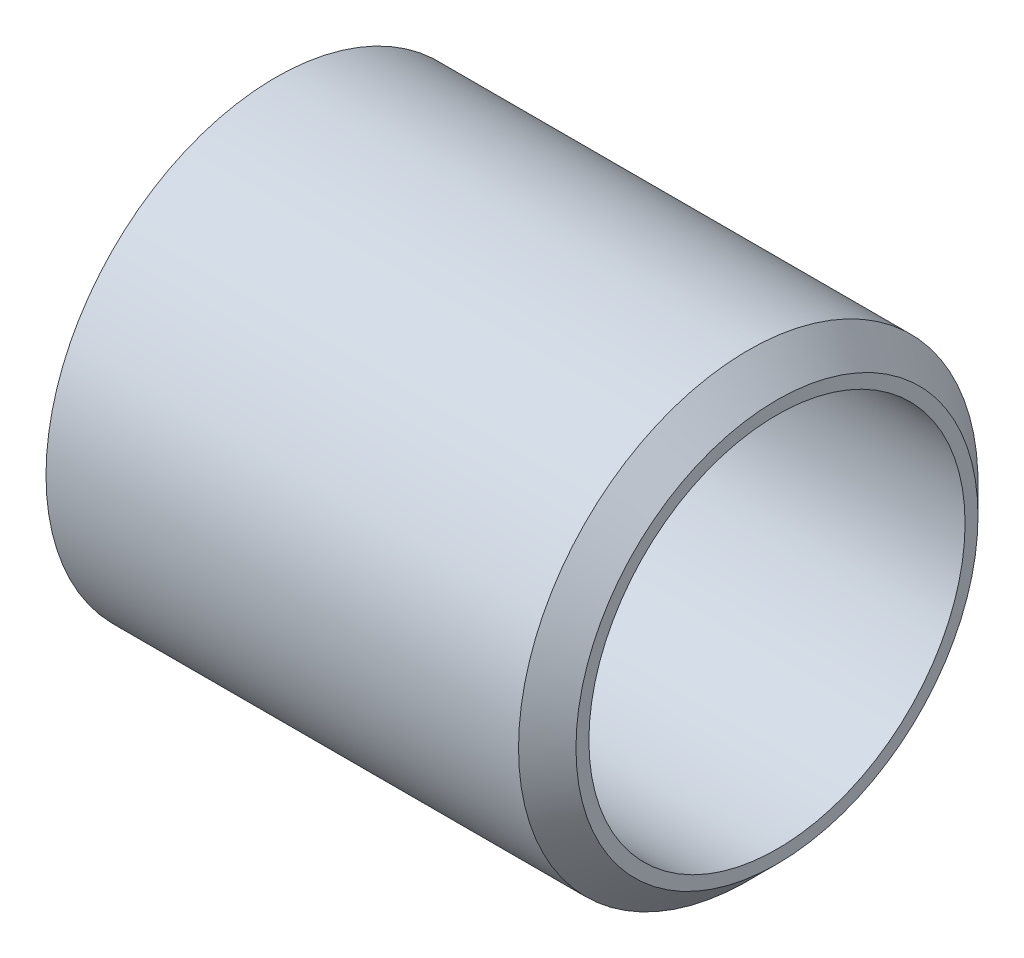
ISO-10303-21;
HEADER;
FILE_DESCRIPTION(('STEP AP214'),'2;1');
FILE_NAME('part.step','',(''),(''),'','','');
FILE_SCHEMA(('AUTOMOTIVE_DESIGN { 1 0 10303 214 1 1 1 1 }'));
ENDSEC;
DATA;
#1=APPLICATION_CONTEXT('core data for automotive mechanical design processes');
#2=APPLICATION_PROTOCOL_DEFINITION('international standard','automotive_design',2000,#1);
#3=PRODUCT_CONTEXT('',#1,'mechanical');
#4=PRODUCT('Part','Part','',(#3));
#5=PRODUCT_RELATED_PRODUCT_CATEGORY('part','',(#4));
#6=PRODUCT_DEFINITION_FORMATION('','',#4);
#7=PRODUCT_DEFINITION_CONTEXT('part definition',#1,'design');
#8=PRODUCT_DEFINITION('design','',#6,#7);
#9=PRODUCT_DEFINITION_SHAPE('','',#8);
#10=(LENGTH_UNIT() NAMED_UNIT(*) SI_UNIT(.MILLI.,.METRE.));
#11=(NAMED_UNIT(*) PLANE_ANGLE_UNIT() SI_UNIT($,.RADIAN.));
#12=(NAMED_UNIT(*) SI_UNIT($,.STERADIAN.) SOLID_ANGLE_UNIT());
#13=UNCERTAINTY_MEASURE_WITH_UNIT(LENGTH_MEASURE(1.E-05),#10,'distance_accuracy_value','');
#14=(GEOMETRIC_REPRESENTATION_CONTEXT(3) GLOBAL_UNCERTAINTY_ASSIGNED_CONTEXT((#13)) GLOBAL_UNIT_ASSIGNED_CONTEXT((#10,
#11,#12)) REPRESENTATION_CONTEXT('',''));
#15=CARTESIAN_POINT('',(0.,0.,0.));
#16=DIRECTION('',(0.,0.,1.));
#17=DIRECTION('',(1.,0.,0.));
#18=AXIS2_PLACEMENT_3D('',#15,#16,#17);
#19=CARTESIAN_POINT('',(0.,0.,0.));
#20=DIRECTION('',(-1.,0.,0.));
#21=DIRECTION('',(0.,0.,1.));
#22=AXIS2_PLACEMENT_3D('',#19,#20,#21);
#23=CYLINDRICAL_SURFACE('',#22,34.925);
#24=CARTESIAN_POINT('',(71.834375,0.,0.));
#25=DIRECTION('',(-1.,0.,0.));
#26=DIRECTION('',(0.,0.,1.));
#27=AXIS2_PLACEMENT_3D('',#24,#25,#26);
#28=CIRCLE('',#27,34.925);
#29=CARTESIAN_POINT('',(71.834375,0.,34.925));
#30=VERTEX_POINT('',#29);
#31=EDGE_CURVE('E70',#30,#30,#28,.T.);
#32=ORIENTED_EDGE('',*,*,#31,.T.);
#33=EDGE_LOOP('',(#32));
#34=FACE_BOUND('',#33,.T.);
#35=CARTESIAN_POINT('',(0.,0.,0.));
#36=DIRECTION('',(-1.,0.,0.));
#37=DIRECTION('',(0.,0.,1.));
#38=AXIS2_PLACEMENT_3D('',#35,#36,#37);
#39=CIRCLE('',#38,34.925);
#40=CARTESIAN_POINT('',(0.,0.,34.925));
#41=VERTEX_POINT('',#40);
#42=EDGE_CURVE('E10',#41,#41,#39,.T.);
#43=ORIENTED_EDGE('',*,*,#42,.F.);
#44=EDGE_LOOP('',(#43));
#45=FACE_BOUND('',#44,.T.);
#46=ADVANCED_FACE('F39',(#34,#45),#23,.T.);
#47=CARTESIAN_POINT('',(0.,31.76905,0.));
#48=DIRECTION('',(-1.,0.,0.));
#49=DIRECTION('',(0.,0.,1.));
#50=AXIS2_PLACEMENT_3D('',#47,#48,#49);
#51=PLANE('',#50);
#52=ORIENTED_EDGE('',*,*,#42,.T.);
#53=EDGE_LOOP('',(#52));
#54=FACE_BOUND('',#53,.T.);
#55=CARTESIAN_POINT('',(0.,0.,0.));
#56=DIRECTION('',(-1.,0.,0.));
#57=DIRECTION('',(0.,0.,1.));
#58=AXIS2_PLACEMENT_3D('',#55,#56,#57);
#59=CIRCLE('',#58,31.76905);
#60=CARTESIAN_POINT('',(0.,0.,31.76905));
#61=VERTEX_POINT('',#60);
#62=EDGE_CURVE('E46',#61,#61,#59,.T.);
#63=ORIENTED_EDGE('',*,*,#62,.F.);
#64=EDGE_LOOP('',(#63));
#65=FACE_BOUND('',#64,.T.);
#66=ADVANCED_FACE('F87',(#54,#65),#51,.T.);
#67=CARTESIAN_POINT('',(3.175,0.,0.));
#68=DIRECTION('',(-1.,0.,0.));
#69=DIRECTION('',(0.,0.,1.));
#70=AXIS2_PLACEMENT_3D('',#67,#68,#69);
#71=TOROIDAL_SURFACE('',#70,31.76905,3.175);
#72=CARTESIAN_POINT('',(3.175,0.,0.));
#73=DIRECTION('',(-1.,0.,0.));
#74=DIRECTION('',(0.,0.,1.));
#75=AXIS2_PLACEMENT_3D('',#72,#73,#74);
#76=CIRCLE('',#75,28.59405);
#77=CARTESIAN_POINT('',(3.175,0.,28.59405));
#78=VERTEX_POINT('',#77);
#79=EDGE_CURVE('E52',#78,#78,#76,.T.);
#80=ORIENTED_EDGE('',*,*,#79,.F.);
#81=EDGE_LOOP('',(#80));
#82=FACE_BOUND('',#81,.T.);
#83=ORIENTED_EDGE('',*,*,#62,.T.);
#84=EDGE_LOOP('',(#83));
#85=FACE_BOUND('',#84,.T.);
#86=ADVANCED_FACE('F94',(#82,#85),#71,.T.);
#87=CARTESIAN_POINT('',(0.,0.,0.));
#88=DIRECTION('',(-1.,0.,0.));
#89=DIRECTION('',(0.,0.,1.));
#90=AXIS2_PLACEMENT_3D('',#87,#88,#89);
#91=CYLINDRICAL_SURFACE('',#90,28.59405);
#92=ORIENTED_EDGE('',*,*,#79,.T.);
#93=EDGE_LOOP('',(#92));
#94=FACE_BOUND('',#93,.T.);
#95=CARTESIAN_POINT('',(76.2,0.,0.));
#96=DIRECTION('',(-1.,0.,0.));
#97=DIRECTION('',(0.,0.,1.));
#98=AXIS2_PLACEMENT_3D('',#95,#96,#97);
#99=CIRCLE('',#98,28.59405);
#100=CARTESIAN_POINT('',(76.2,0.,28.59405));
#101=VERTEX_POINT('',#100);
#102=EDGE_CURVE('E56',#101,#101,#99,.T.);
#103=ORIENTED_EDGE('',*,*,#102,.F.);
#104=EDGE_LOOP('',(#103));
#105=FACE_BOUND('',#104,.T.);
#106=ADVANCED_FACE('F81',(#94,#105),#91,.F.);
#107=CARTESIAN_POINT('',(76.2,30.559375,0.));
#108=DIRECTION('',(1.,0.,0.));
#109=DIRECTION('',(0.,0.,-1.));
#110=AXIS2_PLACEMENT_3D('',#107,#108,#109);
#111=PLANE('',#110);
#112=ORIENTED_EDGE('',*,*,#102,.T.);
#113=EDGE_LOOP('',(#112));
#114=FACE_BOUND('',#113,.T.);
#115=CARTESIAN_POINT('',(76.2,0.,0.));
#116=DIRECTION('',(-1.,0.,0.));
#117=DIRECTION('',(0.,0.,1.));
#118=AXIS2_PLACEMENT_3D('',#115,#116,#117);
#119=CIRCLE('',#118,30.559375);
#120=CARTESIAN_POINT('',(76.2,0.,30.559375));
#121=VERTEX_POINT('',#120);
#122=EDGE_CURVE('E63',#121,#121,#119,.T.);
#123=ORIENTED_EDGE('',*,*,#122,.F.);
#124=EDGE_LOOP('',(#123));
#125=FACE_BOUND('',#124,.T.);
#126=ADVANCED_FACE('F76',(#114,#125),#111,.T.);
#127=CARTESIAN_POINT('',(71.834375,0.,0.));
#128=DIRECTION('',(-1.,0.,0.));
#129=DIRECTION('',(0.,0.,1.));
#130=AXIS2_PLACEMENT_3D('',#127,#128,#129);
#131=CONICAL_SURFACE('',#130,34.925,0.785398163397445);
#132=ORIENTED_EDGE('',*,*,#122,.T.);
#133=EDGE_LOOP('',(#132));
#134=FACE_BOUND('',#133,.T.);
#135=ORIENTED_EDGE('',*,*,#31,.F.);
#136=EDGE_LOOP('',(#135));
#137=FACE_BOUND('',#136,.T.);
#138=ADVANCED_FACE('F77',(#134,#137),#131,.T.);
#139=CLOSED_SHELL('',(#46,#66,#86,#106,#126,#138));
#140=MANIFOLD_SOLID_BREP('B2',#139);
#141=ADVANCED_BREP_SHAPE_REPRESENTATION('',(#18,#140),#14);
#142=SHAPE_DEFINITION_REPRESENTATION(#9,#141);
ENDSEC;
END-ISO-10303-21;
